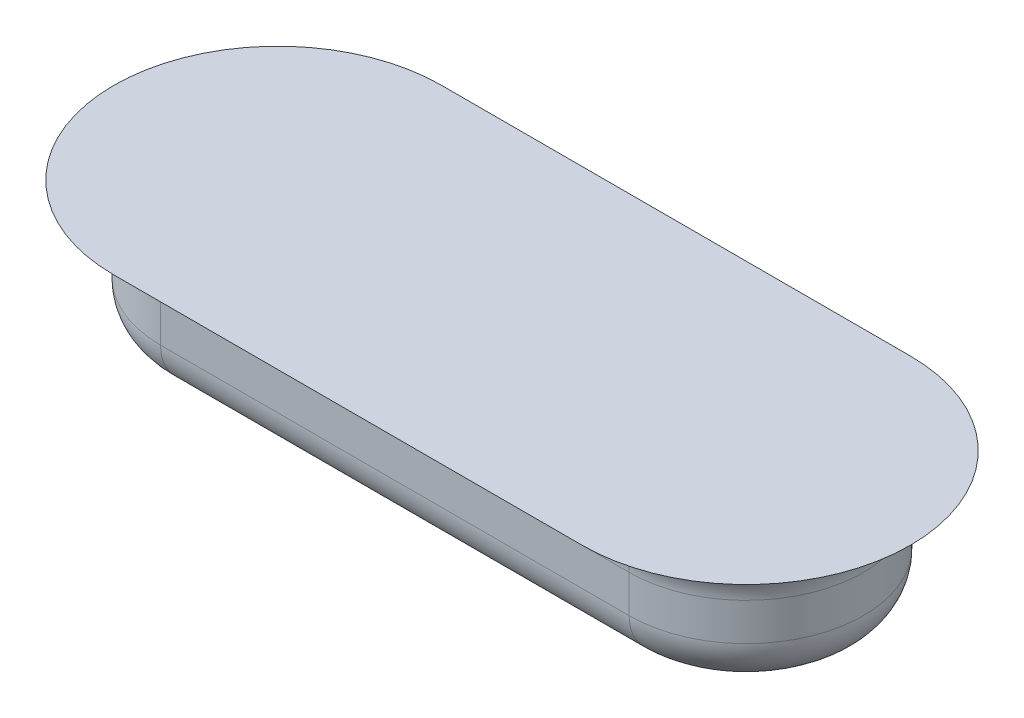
ISO-10303-21;
HEADER;
FILE_DESCRIPTION(('STEP AP214'),'2;1');
FILE_NAME('part.step','',(''),(''),'','','');
FILE_SCHEMA(('AUTOMOTIVE_DESIGN { 1 0 10303 214 1 1 1 1 }'));
ENDSEC;
DATA;
#1=APPLICATION_CONTEXT('core data for automotive mechanical design processes');
#2=APPLICATION_PROTOCOL_DEFINITION('international standard','automotive_design',2000,#1);
#3=PRODUCT_CONTEXT('',#1,'mechanical');
#4=PRODUCT('Part','Part','',(#3));
#5=PRODUCT_RELATED_PRODUCT_CATEGORY('part','',(#4));
#6=PRODUCT_DEFINITION_FORMATION('','',#4);
#7=PRODUCT_DEFINITION_CONTEXT('part definition',#1,'design');
#8=PRODUCT_DEFINITION('design','',#6,#7);
#9=PRODUCT_DEFINITION_SHAPE('','',#8);
#10=(LENGTH_UNIT() NAMED_UNIT(*) SI_UNIT(.MILLI.,.METRE.));
#11=(NAMED_UNIT(*) PLANE_ANGLE_UNIT() SI_UNIT($,.RADIAN.));
#12=(NAMED_UNIT(*) SI_UNIT($,.STERADIAN.) SOLID_ANGLE_UNIT());
#13=UNCERTAINTY_MEASURE_WITH_UNIT(LENGTH_MEASURE(1.E-05),#10,'distance_accuracy_value','');
#14=(GEOMETRIC_REPRESENTATION_CONTEXT(3) GLOBAL_UNCERTAINTY_ASSIGNED_CONTEXT((#13)) GLOBAL_UNIT_ASSIGNED_CONTEXT((#10,
#11,#12)) REPRESENTATION_CONTEXT('',''));
#15=CARTESIAN_POINT('',(0.,0.,0.));
#16=DIRECTION('',(0.,0.,1.));
#17=DIRECTION('',(1.,0.,0.));
#18=AXIS2_PLACEMENT_3D('',#15,#16,#17);
#19=CARTESIAN_POINT('',(-25.4,-14.224,0.));
#20=DIRECTION('',(0.,1.,0.));
#21=DIRECTION('',(0.,0.,1.));
#22=AXIS2_PLACEMENT_3D('',#19,#20,#21);
#23=PLANE('',#22);
#24=CARTESIAN_POINT('',(25.4,-14.224,0.));
#25=DIRECTION('',(0.,1.,0.));
#26=DIRECTION('',(0.,0.,1.));
#27=AXIS2_PLACEMENT_3D('',#24,#25,#26);
#28=CIRCLE('',#27,7.62);
#29=CARTESIAN_POINT('',(25.4,-14.224,-7.62));
#30=VERTEX_POINT('',#29);
#31=CARTESIAN_POINT('',(25.4,-14.224,7.62));
#32=VERTEX_POINT('',#31);
#33=EDGE_CURVE('E45',#30,#32,#28,.F.);
#34=ORIENTED_EDGE('',*,*,#33,.T.);
#35=DIRECTION('',(-1.,0.,0.));
#36=VECTOR('',#35,1.);
#37=CARTESIAN_POINT('',(-25.4,-14.224,7.62));
#38=LINE('',#37,#36);
#39=CARTESIAN_POINT('',(-25.4,-14.224,7.62));
#40=VERTEX_POINT('',#39);
#41=EDGE_CURVE('E138',#32,#40,#38,.T.);
#42=ORIENTED_EDGE('',*,*,#41,.T.);
#43=CARTESIAN_POINT('',(-25.4,-14.224,0.));
#44=DIRECTION('',(0.,1.,0.));
#45=DIRECTION('',(0.,0.,1.));
#46=AXIS2_PLACEMENT_3D('',#43,#44,#45);
#47=CIRCLE('',#46,7.62);
#48=CARTESIAN_POINT('',(-25.4,-14.224,-7.62));
#49=VERTEX_POINT('',#48);
#50=EDGE_CURVE('E134',#40,#49,#47,.F.);
#51=ORIENTED_EDGE('',*,*,#50,.T.);
#52=DIRECTION('',(1.,0.,0.));
#53=VECTOR('',#52,1.);
#54=CARTESIAN_POINT('',(-25.4,-14.224,-7.62));
#55=LINE('',#54,#53);
#56=EDGE_CURVE('E50',#49,#30,#55,.T.);
#57=ORIENTED_EDGE('',*,*,#56,.T.);
#58=EDGE_LOOP('',(#34,#42,#51,#57));
#59=FACE_BOUND('',#58,.T.);
#60=CARTESIAN_POINT('',(0.,-14.224,0.));
#61=DIRECTION('',(0.,1.,0.));
#62=DIRECTION('',(0.,0.,1.));
#63=AXIS2_PLACEMENT_3D('',#60,#61,#62);
#64=CIRCLE('',#63,4.445);
#65=CARTESIAN_POINT('',(0.,-14.224,4.445));
#66=VERTEX_POINT('',#65);
#67=EDGE_CURVE('E11',#66,#66,#64,.F.);
#68=ORIENTED_EDGE('',*,*,#67,.F.);
#69=EDGE_LOOP('',(#68));
#70=FACE_BOUND('',#69,.T.);
#71=ADVANCED_FACE('F29',(#59,#70),#23,.F.);
#72=CARTESIAN_POINT('',(-25.4,-14.224,0.));
#73=DIRECTION('',(0.,1.,0.));
#74=DIRECTION('',(0.,0.,1.));
#75=AXIS2_PLACEMENT_3D('',#72,#73,#74);
#76=CYLINDRICAL_SURFACE('',#75,12.7);
#77=DIRECTION('',(0.,1.,0.));
#78=VECTOR('',#77,1.);
#79=CARTESIAN_POINT('',(-25.4,-14.224,12.7));
#80=LINE('',#79,#78);
#81=CARTESIAN_POINT('',(-25.4,-9.14399999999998,12.7));
#82=VERTEX_POINT('',#81);
#83=CARTESIAN_POINT('',(-25.4,-5.08,12.7));
#84=VERTEX_POINT('',#83);
#85=EDGE_CURVE('E177',#82,#84,#80,.T.);
#86=ORIENTED_EDGE('',*,*,#85,.T.);
#87=CARTESIAN_POINT('',(-25.4,-5.08,0.));
#88=DIRECTION('',(0.,1.,0.));
#89=DIRECTION('',(0.,0.,1.));
#90=AXIS2_PLACEMENT_3D('',#87,#88,#89);
#91=CIRCLE('',#90,12.7);
#92=CARTESIAN_POINT('',(-25.4,-5.08,-12.7));
#93=VERTEX_POINT('',#92);
#94=EDGE_CURVE('E111',#84,#93,#91,.F.);
#95=ORIENTED_EDGE('',*,*,#94,.T.);
#96=DIRECTION('',(0.,1.,0.));
#97=VECTOR('',#96,1.);
#98=CARTESIAN_POINT('',(-25.4,-14.224,-12.7));
#99=LINE('',#98,#97);
#100=CARTESIAN_POINT('',(-25.4,-9.14399999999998,-12.7));
#101=VERTEX_POINT('',#100);
#102=EDGE_CURVE('E147',#101,#93,#99,.T.);
#103=ORIENTED_EDGE('',*,*,#102,.F.);
#104=CARTESIAN_POINT('',(-25.4,-9.14399999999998,0.));
#105=DIRECTION('',(0.,1.,0.));
#106=DIRECTION('',(0.,0.,1.));
#107=AXIS2_PLACEMENT_3D('',#104,#105,#106);
#108=CIRCLE('',#107,12.7);
#109=EDGE_CURVE('E156',#101,#82,#108,.T.);
#110=ORIENTED_EDGE('',*,*,#109,.T.);
#111=EDGE_LOOP('',(#86,#95,#103,#110));
#112=FACE_BOUND('',#111,.T.);
#113=ADVANCED_FACE('F31',(#112),#76,.T.);
#114=CARTESIAN_POINT('',(-25.4,-14.224,-12.7));
#115=DIRECTION('',(0.,0.,1.));
#116=DIRECTION('',(1.,0.,0.));
#117=AXIS2_PLACEMENT_3D('',#114,#115,#116);
#118=PLANE('',#117);
#119=DIRECTION('',(0.,1.,0.));
#120=VECTOR('',#119,1.);
#121=CARTESIAN_POINT('',(25.4,-14.224,-12.7));
#122=LINE('',#121,#120);
#123=CARTESIAN_POINT('',(25.4,-9.14399999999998,-12.7));
#124=VERTEX_POINT('',#123);
#125=CARTESIAN_POINT('',(25.4,-5.08,-12.7));
#126=VERTEX_POINT('',#125);
#127=EDGE_CURVE('E149',#124,#126,#122,.T.);
#128=ORIENTED_EDGE('',*,*,#127,.F.);
#129=DIRECTION('',(1.,0.,0.));
#130=VECTOR('',#129,1.);
#131=CARTESIAN_POINT('',(-25.4,-9.14399999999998,-12.7));
#132=LINE('',#131,#130);
#133=EDGE_CURVE('E38',#124,#101,#132,.F.);
#134=ORIENTED_EDGE('',*,*,#133,.T.);
#135=ORIENTED_EDGE('',*,*,#102,.T.);
#136=DIRECTION('',(1.,0.,0.));
#137=VECTOR('',#136,1.);
#138=CARTESIAN_POINT('',(25.4,-5.08,-12.7));
#139=LINE('',#138,#137);
#140=EDGE_CURVE('E140',#93,#126,#139,.T.);
#141=ORIENTED_EDGE('',*,*,#140,.T.);
#142=EDGE_LOOP('',(#128,#134,#135,#141));
#143=FACE_BOUND('',#142,.T.);
#144=ADVANCED_FACE('F146',(#143),#118,.F.);
#145=CARTESIAN_POINT('',(25.4,-14.224,0.));
#146=DIRECTION('',(0.,1.,0.));
#147=DIRECTION('',(0.,0.,1.));
#148=AXIS2_PLACEMENT_3D('',#145,#146,#147);
#149=CYLINDRICAL_SURFACE('',#148,12.7);
#150=ORIENTED_EDGE('',*,*,#127,.T.);
#151=CARTESIAN_POINT('',(25.4,-5.08,0.));
#152=DIRECTION('',(0.,1.,0.));
#153=DIRECTION('',(0.,0.,1.));
#154=AXIS2_PLACEMENT_3D('',#151,#152,#153);
#155=CIRCLE('',#154,12.7);
#156=CARTESIAN_POINT('',(25.4,-5.08,12.7));
#157=VERTEX_POINT('',#156);
#158=EDGE_CURVE('E132',#126,#157,#155,.F.);
#159=ORIENTED_EDGE('',*,*,#158,.T.);
#160=DIRECTION('',(0.,1.,0.));
#161=VECTOR('',#160,1.);
#162=CARTESIAN_POINT('',(25.4,-14.224,12.7));
#163=LINE('',#162,#161);
#164=CARTESIAN_POINT('',(25.4,-9.14399999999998,12.7));
#165=VERTEX_POINT('',#164);
#166=EDGE_CURVE('E174',#165,#157,#163,.T.);
#167=ORIENTED_EDGE('',*,*,#166,.F.);
#168=CARTESIAN_POINT('',(25.4,-9.14399999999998,0.));
#169=DIRECTION('',(0.,1.,0.));
#170=DIRECTION('',(0.,0.,1.));
#171=AXIS2_PLACEMENT_3D('',#168,#169,#170);
#172=CIRCLE('',#171,12.7);
#173=EDGE_CURVE('E130',#165,#124,#172,.T.);
#174=ORIENTED_EDGE('',*,*,#173,.T.);
#175=EDGE_LOOP('',(#150,#159,#167,#174));
#176=FACE_BOUND('',#175,.T.);
#177=ADVANCED_FACE('F204',(#176),#149,.T.);
#178=CARTESIAN_POINT('',(-25.4,-14.224,12.7));
#179=DIRECTION('',(0.,0.,-1.));
#180=DIRECTION('',(-1.,0.,0.));
#181=AXIS2_PLACEMENT_3D('',#178,#179,#180);
#182=PLANE('',#181);
#183=ORIENTED_EDGE('',*,*,#166,.T.);
#184=DIRECTION('',(-1.,0.,0.));
#185=VECTOR('',#184,1.);
#186=CARTESIAN_POINT('',(-25.4,-5.08,12.7));
#187=LINE('',#186,#185);
#188=EDGE_CURVE('E128',#157,#84,#187,.T.);
#189=ORIENTED_EDGE('',*,*,#188,.T.);
#190=ORIENTED_EDGE('',*,*,#85,.F.);
#191=DIRECTION('',(-1.,0.,0.));
#192=VECTOR('',#191,1.);
#193=CARTESIAN_POINT('',(-25.4,-9.14399999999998,12.7));
#194=LINE('',#193,#192);
#195=EDGE_CURVE('E104',#82,#165,#194,.F.);
#196=ORIENTED_EDGE('',*,*,#195,.T.);
#197=EDGE_LOOP('',(#183,#189,#190,#196));
#198=FACE_BOUND('',#197,.T.);
#199=ADVANCED_FACE('F197',(#198),#182,.F.);
#200=ORIENTED_EDGE('',*,*,#67,.T.);
#201=EDGE_LOOP('',(#200));
#202=FACE_BOUND('',#201,.T.);
#203=ADVANCED_FACE('F192',(#202),#23,.F.);
#204=CARTESIAN_POINT('',(25.4,-5.08,0.));
#205=DIRECTION('',(0.,1.,0.));
#206=DIRECTION('',(0.,0.,1.));
#207=AXIS2_PLACEMENT_3D('',#204,#205,#206);
#208=TOROIDAL_SURFACE('',#207,17.78,5.08);
#209=CARTESIAN_POINT('',(25.4,-5.08,-17.78));
#210=DIRECTION('',(1.,0.,0.));
#211=DIRECTION('',(0.,0.,-1.));
#212=AXIS2_PLACEMENT_3D('',#209,#210,#211);
#213=CIRCLE('',#212,5.08);
#214=CARTESIAN_POINT('',(25.4,0.,-17.78));
#215=VERTEX_POINT('',#214);
#216=EDGE_CURVE('E114',#215,#126,#213,.T.);
#217=ORIENTED_EDGE('',*,*,#216,.F.);
#218=CARTESIAN_POINT('',(25.4,0.,0.));
#219=DIRECTION('',(0.,1.,0.));
#220=DIRECTION('',(0.,0.,1.));
#221=AXIS2_PLACEMENT_3D('',#218,#219,#220);
#222=CIRCLE('',#221,17.78);
#223=CARTESIAN_POINT('',(25.4,0.,17.78));
#224=VERTEX_POINT('',#223);
#225=EDGE_CURVE('E121',#224,#215,#222,.T.);
#226=ORIENTED_EDGE('',*,*,#225,.F.);
#227=CARTESIAN_POINT('',(25.4,-5.08,17.78));
#228=DIRECTION('',(1.,0.,0.));
#229=DIRECTION('',(0.,0.,-1.));
#230=AXIS2_PLACEMENT_3D('',#227,#228,#229);
#231=CIRCLE('',#230,5.08);
#232=EDGE_CURVE('E120',#157,#224,#231,.T.);
#233=ORIENTED_EDGE('',*,*,#232,.F.);
#234=ORIENTED_EDGE('',*,*,#158,.F.);
#235=EDGE_LOOP('',(#217,#226,#233,#234));
#236=FACE_BOUND('',#235,.T.);
#237=ADVANCED_FACE('F196',(#236),#208,.F.);
#238=CARTESIAN_POINT('',(-25.4,-5.08,17.78));
#239=DIRECTION('',(1.,0.,0.));
#240=DIRECTION('',(0.,0.,-1.));
#241=AXIS2_PLACEMENT_3D('',#238,#239,#240);
#242=CYLINDRICAL_SURFACE('',#241,5.08);
#243=ORIENTED_EDGE('',*,*,#232,.T.);
#244=DIRECTION('',(-1.,0.,0.));
#245=VECTOR('',#244,1.);
#246=CARTESIAN_POINT('',(25.4,0.,17.78));
#247=LINE('',#246,#245);
#248=CARTESIAN_POINT('',(-25.4,0.,17.78));
#249=VERTEX_POINT('',#248);
#250=EDGE_CURVE('E98',#249,#224,#247,.F.);
#251=ORIENTED_EDGE('',*,*,#250,.F.);
#252=CARTESIAN_POINT('',(-25.4,-5.08,17.78));
#253=DIRECTION('',(1.,0.,0.));
#254=DIRECTION('',(0.,0.,-1.));
#255=AXIS2_PLACEMENT_3D('',#252,#253,#254);
#256=CIRCLE('',#255,5.08);
#257=EDGE_CURVE('E108',#84,#249,#256,.T.);
#258=ORIENTED_EDGE('',*,*,#257,.F.);
#259=ORIENTED_EDGE('',*,*,#188,.F.);
#260=EDGE_LOOP('',(#243,#251,#258,#259));
#261=FACE_BOUND('',#260,.T.);
#262=ADVANCED_FACE('F118',(#261),#242,.F.);
#263=CARTESIAN_POINT('',(-25.4,-5.08,-17.78));
#264=DIRECTION('',(-1.,0.,0.));
#265=DIRECTION('',(0.,0.,1.));
#266=AXIS2_PLACEMENT_3D('',#263,#264,#265);
#267=CYLINDRICAL_SURFACE('',#266,5.08);
#268=ORIENTED_EDGE('',*,*,#216,.T.);
#269=ORIENTED_EDGE('',*,*,#140,.F.);
#270=CARTESIAN_POINT('',(-25.4,-5.08,-17.78));
#271=DIRECTION('',(1.,0.,0.));
#272=DIRECTION('',(0.,0.,-1.));
#273=AXIS2_PLACEMENT_3D('',#270,#271,#272);
#274=CIRCLE('',#273,5.08);
#275=CARTESIAN_POINT('',(-25.4,0.,-17.78));
#276=VERTEX_POINT('',#275);
#277=EDGE_CURVE('E115',#276,#93,#274,.T.);
#278=ORIENTED_EDGE('',*,*,#277,.F.);
#279=DIRECTION('',(1.,0.,0.));
#280=VECTOR('',#279,1.);
#281=CARTESIAN_POINT('',(-25.4,0.,-17.78));
#282=LINE('',#281,#280);
#283=EDGE_CURVE('E101',#215,#276,#282,.F.);
#284=ORIENTED_EDGE('',*,*,#283,.F.);
#285=EDGE_LOOP('',(#268,#269,#278,#284));
#286=FACE_BOUND('',#285,.T.);
#287=ADVANCED_FACE('F240',(#286),#267,.F.);
#288=CARTESIAN_POINT('',(-25.4,-5.08,0.));
#289=DIRECTION('',(0.,1.,0.));
#290=DIRECTION('',(0.,0.,1.));
#291=AXIS2_PLACEMENT_3D('',#288,#289,#290);
#292=TOROIDAL_SURFACE('',#291,17.78,5.08);
#293=ORIENTED_EDGE('',*,*,#257,.T.);
#294=CARTESIAN_POINT('',(-25.4,0.,0.));
#295=DIRECTION('',(0.,1.,0.));
#296=DIRECTION('',(0.,0.,1.));
#297=AXIS2_PLACEMENT_3D('',#294,#295,#296);
#298=CIRCLE('',#297,17.78);
#299=EDGE_CURVE('E94',#276,#249,#298,.T.);
#300=ORIENTED_EDGE('',*,*,#299,.F.);
#301=ORIENTED_EDGE('',*,*,#277,.T.);
#302=ORIENTED_EDGE('',*,*,#94,.F.);
#303=EDGE_LOOP('',(#293,#300,#301,#302));
#304=FACE_BOUND('',#303,.T.);
#305=ADVANCED_FACE('F109',(#304),#292,.F.);
#306=CARTESIAN_POINT('',(-25.4,-9.14399999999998,-7.62));
#307=DIRECTION('',(1.,0.,0.));
#308=DIRECTION('',(0.,0.,-1.));
#309=AXIS2_PLACEMENT_3D('',#306,#307,#308);
#310=CYLINDRICAL_SURFACE('',#309,5.08);
#311=CARTESIAN_POINT('',(-25.4,-9.14399999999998,-7.62));
#312=DIRECTION('',(-1.,0.,0.));
#313=DIRECTION('',(0.,0.,1.));
#314=AXIS2_PLACEMENT_3D('',#311,#312,#313);
#315=CIRCLE('',#314,5.08);
#316=EDGE_CURVE('E160',#101,#49,#315,.T.);
#317=ORIENTED_EDGE('',*,*,#316,.F.);
#318=ORIENTED_EDGE('',*,*,#133,.F.);
#319=CARTESIAN_POINT('',(25.4,-9.14399999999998,-7.62));
#320=DIRECTION('',(1.,0.,0.));
#321=DIRECTION('',(0.,0.,-1.));
#322=AXIS2_PLACEMENT_3D('',#319,#320,#321);
#323=CIRCLE('',#322,5.08);
#324=EDGE_CURVE('E164',#30,#124,#323,.T.);
#325=ORIENTED_EDGE('',*,*,#324,.F.);
#326=ORIENTED_EDGE('',*,*,#56,.F.);
#327=EDGE_LOOP('',(#317,#318,#325,#326));
#328=FACE_BOUND('',#327,.T.);
#329=ADVANCED_FACE('F161',(#328),#310,.T.);
#330=CARTESIAN_POINT('',(25.4,-9.14399999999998,0.));
#331=DIRECTION('',(0.,1.,0.));
#332=DIRECTION('',(0.,0.,1.));
#333=AXIS2_PLACEMENT_3D('',#330,#331,#332);
#334=TOROIDAL_SURFACE('',#333,7.62,5.08);
#335=ORIENTED_EDGE('',*,*,#324,.T.);
#336=ORIENTED_EDGE('',*,*,#173,.F.);
#337=CARTESIAN_POINT('',(25.4,-9.14399999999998,7.62));
#338=DIRECTION('',(-1.,0.,0.));
#339=DIRECTION('',(0.,0.,1.));
#340=AXIS2_PLACEMENT_3D('',#337,#338,#339);
#341=CIRCLE('',#340,5.08);
#342=EDGE_CURVE('E165',#32,#165,#341,.T.);
#343=ORIENTED_EDGE('',*,*,#342,.F.);
#344=ORIENTED_EDGE('',*,*,#33,.F.);
#345=EDGE_LOOP('',(#335,#336,#343,#344));
#346=FACE_BOUND('',#345,.T.);
#347=ADVANCED_FACE('F259',(#346),#334,.T.);
#348=CARTESIAN_POINT('',(-25.4,-9.14399999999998,0.));
#349=DIRECTION('',(0.,1.,0.));
#350=DIRECTION('',(0.,0.,1.));
#351=AXIS2_PLACEMENT_3D('',#348,#349,#350);
#352=TOROIDAL_SURFACE('',#351,7.62,5.08);
#353=ORIENTED_EDGE('',*,*,#316,.T.);
#354=ORIENTED_EDGE('',*,*,#50,.F.);
#355=CARTESIAN_POINT('',(-25.4,-9.14399999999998,7.62));
#356=DIRECTION('',(1.,0.,0.));
#357=DIRECTION('',(0.,0.,-1.));
#358=AXIS2_PLACEMENT_3D('',#355,#356,#357);
#359=CIRCLE('',#358,5.08);
#360=EDGE_CURVE('E169',#82,#40,#359,.T.);
#361=ORIENTED_EDGE('',*,*,#360,.F.);
#362=ORIENTED_EDGE('',*,*,#109,.F.);
#363=EDGE_LOOP('',(#353,#354,#361,#362));
#364=FACE_BOUND('',#363,.T.);
#365=ADVANCED_FACE('F168',(#364),#352,.T.);
#366=CARTESIAN_POINT('',(-25.4,-9.14399999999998,7.62));
#367=DIRECTION('',(-1.,0.,0.));
#368=DIRECTION('',(0.,0.,1.));
#369=AXIS2_PLACEMENT_3D('',#366,#367,#368);
#370=CYLINDRICAL_SURFACE('',#369,5.08);
#371=ORIENTED_EDGE('',*,*,#342,.T.);
#372=ORIENTED_EDGE('',*,*,#195,.F.);
#373=ORIENTED_EDGE('',*,*,#360,.T.);
#374=ORIENTED_EDGE('',*,*,#41,.F.);
#375=EDGE_LOOP('',(#371,#372,#373,#374));
#376=FACE_BOUND('',#375,.T.);
#377=ADVANCED_FACE('F188',(#376),#370,.T.);
#378=CARTESIAN_POINT('',(-80.1805970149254,0.,62.5522388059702));
#379=DIRECTION('',(0.,-1.,0.));
#380=DIRECTION('',(0.,0.,-1.));
#381=AXIS2_PLACEMENT_3D('',#378,#379,#380);
#382=PLANE('',#381);
#383=ORIENTED_EDGE('',*,*,#283,.T.);
#384=ORIENTED_EDGE('',*,*,#299,.T.);
#385=ORIENTED_EDGE('',*,*,#250,.T.);
#386=ORIENTED_EDGE('',*,*,#225,.T.);
#387=EDGE_LOOP('',(#383,#384,#385,#386));
#388=FACE_BOUND('',#387,.T.);
#389=ADVANCED_FACE('F96',(#388),#382,.F.);
#390=CLOSED_SHELL('',(#71,#113,#144,#177,#199,#203,#237,#262,#287,#305,#329,#347,#365,#377,#389));
#391=MANIFOLD_SOLID_BREP('B2',#390);
#392=ADVANCED_BREP_SHAPE_REPRESENTATION('',(#18,#391),#14);
#393=SHAPE_DEFINITION_REPRESENTATION(#9,#392);
ENDSEC;
END-ISO-10303-21;
